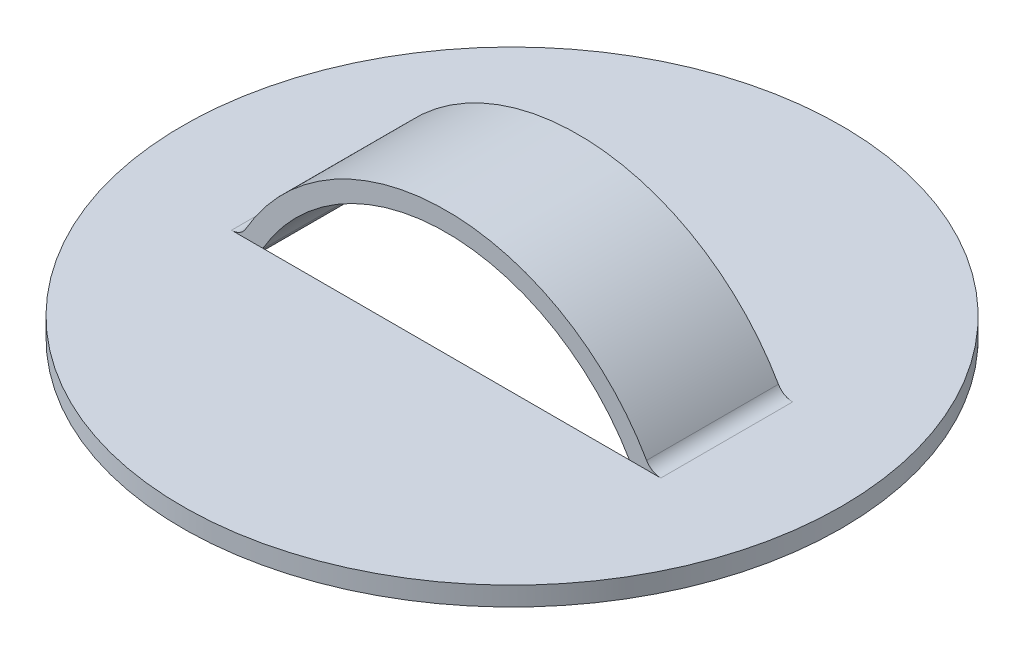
ISO-10303-21;
HEADER;
FILE_DESCRIPTION(('STEP AP214'),'2;1');
FILE_NAME('part.step','',(''),(''),'','','');
FILE_SCHEMA(('AUTOMOTIVE_DESIGN { 1 0 10303 214 1 1 1 1 }'));
ENDSEC;
DATA;
#1=APPLICATION_CONTEXT('core data for automotive mechanical design processes');
#2=APPLICATION_PROTOCOL_DEFINITION('international standard','automotive_design',2000,#1);
#3=PRODUCT_CONTEXT('',#1,'mechanical');
#4=PRODUCT('Part','Part','',(#3));
#5=PRODUCT_RELATED_PRODUCT_CATEGORY('part','',(#4));
#6=PRODUCT_DEFINITION_FORMATION('','',#4);
#7=PRODUCT_DEFINITION_CONTEXT('part definition',#1,'design');
#8=PRODUCT_DEFINITION('design','',#6,#7);
#9=PRODUCT_DEFINITION_SHAPE('','',#8);
#10=(LENGTH_UNIT() NAMED_UNIT(*) SI_UNIT(.MILLI.,.METRE.));
#11=(NAMED_UNIT(*) PLANE_ANGLE_UNIT() SI_UNIT($,.RADIAN.));
#12=(NAMED_UNIT(*) SI_UNIT($,.STERADIAN.) SOLID_ANGLE_UNIT());
#13=UNCERTAINTY_MEASURE_WITH_UNIT(LENGTH_MEASURE(1.E-05),#10,'distance_accuracy_value','');
#14=(GEOMETRIC_REPRESENTATION_CONTEXT(3) GLOBAL_UNCERTAINTY_ASSIGNED_CONTEXT((#13)) GLOBAL_UNIT_ASSIGNED_CONTEXT((#10,
#11,#12)) REPRESENTATION_CONTEXT('',''));
#15=CARTESIAN_POINT('',(0.,0.,0.));
#16=DIRECTION('',(0.,0.,1.));
#17=DIRECTION('',(1.,0.,0.));
#18=AXIS2_PLACEMENT_3D('',#15,#16,#17);
#19=CARTESIAN_POINT('',(-10.338517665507,0.7874,6.35));
#20=DIRECTION('',(0.,0.,1.));
#21=DIRECTION('',(1.,0.,0.));
#22=AXIS2_PLACEMENT_3D('',#19,#20,#21);
#23=PLANE('',#22);
#24=CARTESIAN_POINT('',(-10.338517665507,0.7874,6.35));
#25=DIRECTION('',(0.,0.,-1.));
#26=DIRECTION('',(1.,0.,0.));
#27=AXIS2_PLACEMENT_3D('',#24,#25,#26);
#28=CIRCLE('',#27,0.7874);
#29=CARTESIAN_POINT('',(-9.65516148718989,0.396218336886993,6.35));
#30=VERTEX_POINT('',#29);
#31=CARTESIAN_POINT('',(-10.338517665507,0.,6.35));
#32=VERTEX_POINT('',#31);
#33=EDGE_CURVE('E141',#30,#32,#28,.T.);
#34=ORIENTED_EDGE('',*,*,#33,.T.);
#35=DIRECTION('',(-1.,0.,0.));
#36=VECTOR('',#35,1.);
#37=CARTESIAN_POINT('',(-10.338517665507,0.,6.35));
#38=LINE('',#37,#36);
#39=CARTESIAN_POINT('',(-8.82809877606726,0.,6.35));
#40=VERTEX_POINT('',#39);
#41=EDGE_CURVE('E59',#40,#32,#38,.T.);
#42=ORIENTED_EDGE('',*,*,#41,.F.);
#43=CARTESIAN_POINT('',(0.,-5.1308,6.35));
#44=DIRECTION('',(0.,0.,-1.));
#45=DIRECTION('',(1.,0.,0.));
#46=AXIS2_PLACEMENT_3D('',#43,#44,#45);
#47=CIRCLE('',#46,10.2108);
#48=CARTESIAN_POINT('',(8.82809877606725,0.,6.35));
#49=VERTEX_POINT('',#48);
#50=EDGE_CURVE('E195',#40,#49,#47,.T.);
#51=ORIENTED_EDGE('',*,*,#50,.T.);
#52=CARTESIAN_POINT('',(10.338517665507,0.,6.35));
#53=VERTEX_POINT('',#52);
#54=EDGE_CURVE('E191',#53,#49,#38,.T.);
#55=ORIENTED_EDGE('',*,*,#54,.F.);
#56=CARTESIAN_POINT('',(10.338517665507,0.7874,6.35));
#57=DIRECTION('',(0.,0.,-1.));
#58=DIRECTION('',(-1.,0.,0.));
#59=AXIS2_PLACEMENT_3D('',#56,#57,#58);
#60=CIRCLE('',#59,0.7874);
#61=CARTESIAN_POINT('',(9.65516148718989,0.396218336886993,6.35));
#62=VERTEX_POINT('',#61);
#63=EDGE_CURVE('E197',#53,#62,#60,.T.);
#64=ORIENTED_EDGE('',*,*,#63,.T.);
#65=CARTESIAN_POINT('',(0.,-5.1308,6.35));
#66=DIRECTION('',(0.,0.,1.));
#67=DIRECTION('',(1.,0.,0.));
#68=AXIS2_PLACEMENT_3D('',#65,#66,#67);
#69=CIRCLE('',#68,11.1252);
#70=EDGE_CURVE('E145',#62,#30,#69,.T.);
#71=ORIENTED_EDGE('',*,*,#70,.T.);
#72=EDGE_LOOP('',(#34,#42,#51,#55,#64,#71));
#73=FACE_BOUND('',#72,.T.);
#74=ADVANCED_FACE('F37',(#73),#23,.T.);
#75=CARTESIAN_POINT('',(-10.338517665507,0.7874,0.));
#76=DIRECTION('',(0.,0.,1.));
#77=DIRECTION('',(1.,0.,0.));
#78=AXIS2_PLACEMENT_3D('',#75,#76,#77);
#79=PLANE('',#78);
#80=DIRECTION('',(1.,0.,0.));
#81=VECTOR('',#80,1.);
#82=CARTESIAN_POINT('',(-10.338517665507,0.,0.));
#83=LINE('',#82,#81);
#84=CARTESIAN_POINT('',(-10.338517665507,0.,0.));
#85=VERTEX_POINT('',#84);
#86=CARTESIAN_POINT('',(-8.82809877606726,0.,0.));
#87=VERTEX_POINT('',#86);
#88=EDGE_CURVE('E114',#85,#87,#83,.T.);
#89=ORIENTED_EDGE('',*,*,#88,.F.);
#90=CARTESIAN_POINT('',(-10.338517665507,0.7874,0.));
#91=DIRECTION('',(0.,0.,-1.));
#92=DIRECTION('',(1.,0.,0.));
#93=AXIS2_PLACEMENT_3D('',#90,#91,#92);
#94=CIRCLE('',#93,0.7874);
#95=CARTESIAN_POINT('',(-9.65516148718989,0.396218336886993,0.));
#96=VERTEX_POINT('',#95);
#97=EDGE_CURVE('E118',#96,#85,#94,.T.);
#98=ORIENTED_EDGE('',*,*,#97,.F.);
#99=CARTESIAN_POINT('',(0.,-5.1308,0.));
#100=DIRECTION('',(0.,0.,1.));
#101=DIRECTION('',(1.,0.,0.));
#102=AXIS2_PLACEMENT_3D('',#99,#100,#101);
#103=CIRCLE('',#102,11.1252);
#104=CARTESIAN_POINT('',(9.65516148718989,0.396218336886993,0.));
#105=VERTEX_POINT('',#104);
#106=EDGE_CURVE('E137',#105,#96,#103,.T.);
#107=ORIENTED_EDGE('',*,*,#106,.F.);
#108=CARTESIAN_POINT('',(10.338517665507,0.7874,0.));
#109=DIRECTION('',(0.,0.,-1.));
#110=DIRECTION('',(-1.,0.,0.));
#111=AXIS2_PLACEMENT_3D('',#108,#109,#110);
#112=CIRCLE('',#111,0.7874);
#113=CARTESIAN_POINT('',(10.338517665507,0.,0.));
#114=VERTEX_POINT('',#113);
#115=EDGE_CURVE('E207',#114,#105,#112,.T.);
#116=ORIENTED_EDGE('',*,*,#115,.F.);
#117=DIRECTION('',(1.,0.,0.));
#118=VECTOR('',#117,1.);
#119=CARTESIAN_POINT('',(-10.338517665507,0.,0.));
#120=LINE('',#119,#118);
#121=CARTESIAN_POINT('',(8.82809877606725,0.,0.));
#122=VERTEX_POINT('',#121);
#123=EDGE_CURVE('E11',#122,#114,#120,.T.);
#124=ORIENTED_EDGE('',*,*,#123,.F.);
#125=CARTESIAN_POINT('',(0.,-5.1308,0.));
#126=DIRECTION('',(0.,0.,-1.));
#127=DIRECTION('',(1.,0.,0.));
#128=AXIS2_PLACEMENT_3D('',#125,#126,#127);
#129=CIRCLE('',#128,10.2108);
#130=EDGE_CURVE('E121',#87,#122,#129,.T.);
#131=ORIENTED_EDGE('',*,*,#130,.F.);
#132=EDGE_LOOP('',(#89,#98,#107,#116,#124,#131));
#133=FACE_BOUND('',#132,.T.);
#134=ADVANCED_FACE('F116',(#133),#79,.F.);
#135=CARTESIAN_POINT('',(-10.338517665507,0.7874,6.35));
#136=DIRECTION('',(0.,0.,-1.));
#137=DIRECTION('',(-1.,0.,0.));
#138=AXIS2_PLACEMENT_3D('',#135,#136,#137);
#139=CYLINDRICAL_SURFACE('',#138,1.7018);
#140=CARTESIAN_POINT('',(-10.338517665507,0.7874,0.));
#141=DIRECTION('',(0.,0.,1.));
#142=DIRECTION('',(1.,0.,0.));
#143=AXIS2_PLACEMENT_3D('',#140,#141,#142);
#144=CIRCLE('',#143,1.7018);
#145=CARTESIAN_POINT('',(-10.338517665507,-0.914399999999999,0.));
#146=VERTEX_POINT('',#145);
#147=CARTESIAN_POINT('',(-8.86158657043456,-0.0580571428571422,0.));
#148=VERTEX_POINT('',#147);
#149=EDGE_CURVE('E167',#146,#148,#144,.T.);
#150=ORIENTED_EDGE('',*,*,#149,.T.);
#151=DIRECTION('',(0.,0.,-1.));
#152=VECTOR('',#151,1.);
#153=CARTESIAN_POINT('',(-8.86158657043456,-0.0580571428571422,6.35));
#154=LINE('',#153,#152);
#155=CARTESIAN_POINT('',(-8.86158657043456,-0.0580571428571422,6.35));
#156=VERTEX_POINT('',#155);
#157=EDGE_CURVE('E160',#156,#148,#154,.T.);
#158=ORIENTED_EDGE('',*,*,#157,.F.);
#159=CARTESIAN_POINT('',(-10.338517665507,0.7874,6.35));
#160=DIRECTION('',(0.,0.,1.));
#161=DIRECTION('',(1.,0.,0.));
#162=AXIS2_PLACEMENT_3D('',#159,#160,#161);
#163=CIRCLE('',#162,1.7018);
#164=CARTESIAN_POINT('',(-10.338517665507,-0.914400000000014,6.35));
#165=VERTEX_POINT('',#164);
#166=EDGE_CURVE('E136',#165,#156,#163,.T.);
#167=ORIENTED_EDGE('',*,*,#166,.F.);
#168=DIRECTION('',(0.,0.,-1.));
#169=VECTOR('',#168,1.);
#170=CARTESIAN_POINT('',(-10.338517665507,-0.914399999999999,6.35));
#171=LINE('',#170,#169);
#172=EDGE_CURVE('E45',#165,#146,#171,.T.);
#173=ORIENTED_EDGE('',*,*,#172,.T.);
#174=EDGE_LOOP('',(#150,#158,#167,#173));
#175=FACE_BOUND('',#174,.T.);
#176=ADVANCED_FACE('F39',(#175),#139,.T.);
#177=CARTESIAN_POINT('',(0.,-5.1308,6.35));
#178=DIRECTION('',(0.,0.,-1.));
#179=DIRECTION('',(-1.,0.,0.));
#180=AXIS2_PLACEMENT_3D('',#177,#178,#179);
#181=CYLINDRICAL_SURFACE('',#180,10.2108);
#182=EDGE_CURVE('E202',#148,#87,#129,.T.);
#183=ORIENTED_EDGE('',*,*,#182,.T.);
#184=ORIENTED_EDGE('',*,*,#130,.T.);
#185=CARTESIAN_POINT('',(8.86158657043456,-0.0580571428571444,0.));
#186=VERTEX_POINT('',#185);
#187=EDGE_CURVE('E201',#122,#186,#129,.T.);
#188=ORIENTED_EDGE('',*,*,#187,.T.);
#189=DIRECTION('',(0.,0.,-1.));
#190=VECTOR('',#189,1.);
#191=CARTESIAN_POINT('',(8.86158657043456,-0.0580571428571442,6.35));
#192=LINE('',#191,#190);
#193=CARTESIAN_POINT('',(8.86158657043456,-0.0580571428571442,6.35));
#194=VERTEX_POINT('',#193);
#195=EDGE_CURVE('E157',#194,#186,#192,.T.);
#196=ORIENTED_EDGE('',*,*,#195,.F.);
#197=EDGE_CURVE('E52',#49,#194,#47,.T.);
#198=ORIENTED_EDGE('',*,*,#197,.F.);
#199=ORIENTED_EDGE('',*,*,#50,.F.);
#200=EDGE_CURVE('E193',#156,#40,#47,.T.);
#201=ORIENTED_EDGE('',*,*,#200,.F.);
#202=ORIENTED_EDGE('',*,*,#157,.T.);
#203=EDGE_LOOP('',(#183,#184,#188,#196,#198,#199,#201,#202));
#204=FACE_BOUND('',#203,.T.);
#205=ADVANCED_FACE('F221',(#204),#181,.F.);
#206=CARTESIAN_POINT('',(10.338517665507,0.7874,6.35));
#207=DIRECTION('',(0.,0.,-1.));
#208=DIRECTION('',(-1.,0.,0.));
#209=AXIS2_PLACEMENT_3D('',#206,#207,#208);
#210=CYLINDRICAL_SURFACE('',#209,1.7018);
#211=CARTESIAN_POINT('',(10.338517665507,0.7874,0.));
#212=DIRECTION('',(0.,0.,1.));
#213=DIRECTION('',(-1.,0.,0.));
#214=AXIS2_PLACEMENT_3D('',#211,#212,#213);
#215=CIRCLE('',#214,1.7018);
#216=CARTESIAN_POINT('',(10.338517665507,-0.914400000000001,0.));
#217=VERTEX_POINT('',#216);
#218=EDGE_CURVE('E204',#186,#217,#215,.T.);
#219=ORIENTED_EDGE('',*,*,#218,.T.);
#220=DIRECTION('',(0.,0.,-1.));
#221=VECTOR('',#220,1.);
#222=CARTESIAN_POINT('',(10.338517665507,-0.914400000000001,6.35));
#223=LINE('',#222,#221);
#224=CARTESIAN_POINT('',(10.338517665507,-0.914400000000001,6.35));
#225=VERTEX_POINT('',#224);
#226=EDGE_CURVE('E154',#225,#217,#223,.T.);
#227=ORIENTED_EDGE('',*,*,#226,.F.);
#228=CARTESIAN_POINT('',(10.338517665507,0.7874,6.35));
#229=DIRECTION('',(0.,0.,1.));
#230=DIRECTION('',(-1.,0.,0.));
#231=AXIS2_PLACEMENT_3D('',#228,#229,#230);
#232=CIRCLE('',#231,1.7018);
#233=EDGE_CURVE('E180',#194,#225,#232,.T.);
#234=ORIENTED_EDGE('',*,*,#233,.F.);
#235=ORIENTED_EDGE('',*,*,#195,.T.);
#236=EDGE_LOOP('',(#219,#227,#234,#235));
#237=FACE_BOUND('',#236,.T.);
#238=ADVANCED_FACE('F246',(#237),#210,.T.);
#239=CARTESIAN_POINT('',(10.338517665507,-0.914400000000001,6.35));
#240=DIRECTION('',(0.,1.,0.));
#241=DIRECTION('',(-1.,0.,0.));
#242=AXIS2_PLACEMENT_3D('',#239,#240,#241);
#243=PLANE('',#242);
#244=CARTESIAN_POINT('',(0.,-0.914400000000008,3.175));
#245=DIRECTION('',(0.,-1.,0.));
#246=DIRECTION('',(1.,0.,0.));
#247=AXIS2_PLACEMENT_3D('',#244,#245,#246);
#248=CIRCLE('',#247,15.875);
#249=CARTESIAN_POINT('',(15.875,-0.914399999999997,3.175));
#250=VERTEX_POINT('',#249);
#251=EDGE_CURVE('E188',#250,#250,#248,.T.);
#252=ORIENTED_EDGE('',*,*,#251,.T.);
#253=EDGE_LOOP('',(#252));
#254=FACE_BOUND('',#253,.T.);
#255=ORIENTED_EDGE('',*,*,#172,.F.);
#256=DIRECTION('',(-1.,0.,0.));
#257=VECTOR('',#256,1.);
#258=CARTESIAN_POINT('',(-10.338517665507,-0.914400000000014,6.35));
#259=LINE('',#258,#257);
#260=EDGE_CURVE('E173',#225,#165,#259,.T.);
#261=ORIENTED_EDGE('',*,*,#260,.F.);
#262=ORIENTED_EDGE('',*,*,#226,.T.);
#263=DIRECTION('',(1.,0.,0.));
#264=VECTOR('',#263,1.);
#265=CARTESIAN_POINT('',(-10.338517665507,-0.914400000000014,0.));
#266=LINE('',#265,#264);
#267=EDGE_CURVE('E174',#146,#217,#266,.T.);
#268=ORIENTED_EDGE('',*,*,#267,.F.);
#269=EDGE_LOOP('',(#255,#261,#262,#268));
#270=FACE_BOUND('',#269,.T.);
#271=ADVANCED_FACE('F172',(#254,#270),#243,.F.);
#272=CARTESIAN_POINT('',(10.338517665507,0.7874,6.35));
#273=DIRECTION('',(0.,0.,-1.));
#274=DIRECTION('',(-1.,0.,0.));
#275=AXIS2_PLACEMENT_3D('',#272,#273,#274);
#276=CYLINDRICAL_SURFACE('',#275,0.7874);
#277=ORIENTED_EDGE('',*,*,#115,.T.);
#278=DIRECTION('',(0.,0.,-1.));
#279=VECTOR('',#278,1.);
#280=CARTESIAN_POINT('',(9.65516148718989,0.396218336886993,6.35));
#281=LINE('',#280,#279);
#282=EDGE_CURVE('E143',#62,#105,#281,.T.);
#283=ORIENTED_EDGE('',*,*,#282,.F.);
#284=ORIENTED_EDGE('',*,*,#63,.F.);
#285=DIRECTION('',(0.,0.,-1.));
#286=VECTOR('',#285,1.);
#287=CARTESIAN_POINT('',(10.338517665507,0.,6.35));
#288=LINE('',#287,#286);
#289=EDGE_CURVE('E151',#53,#114,#288,.T.);
#290=ORIENTED_EDGE('',*,*,#289,.T.);
#291=EDGE_LOOP('',(#277,#283,#284,#290));
#292=FACE_BOUND('',#291,.T.);
#293=ADVANCED_FACE('F214',(#292),#276,.F.);
#294=CARTESIAN_POINT('',(0.,-5.1308,6.35));
#295=DIRECTION('',(0.,0.,-1.));
#296=DIRECTION('',(-1.,0.,0.));
#297=AXIS2_PLACEMENT_3D('',#294,#295,#296);
#298=CYLINDRICAL_SURFACE('',#297,11.1252);
#299=ORIENTED_EDGE('',*,*,#106,.T.);
#300=DIRECTION('',(0.,0.,-1.));
#301=VECTOR('',#300,1.);
#302=CARTESIAN_POINT('',(-9.65516148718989,0.396218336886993,6.35));
#303=LINE('',#302,#301);
#304=EDGE_CURVE('E135',#30,#96,#303,.T.);
#305=ORIENTED_EDGE('',*,*,#304,.F.);
#306=ORIENTED_EDGE('',*,*,#70,.F.);
#307=ORIENTED_EDGE('',*,*,#282,.T.);
#308=EDGE_LOOP('',(#299,#305,#306,#307));
#309=FACE_BOUND('',#308,.T.);
#310=ADVANCED_FACE('F209',(#309),#298,.T.);
#311=CARTESIAN_POINT('',(-10.338517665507,0.7874,6.35));
#312=DIRECTION('',(0.,0.,-1.));
#313=DIRECTION('',(-1.,0.,0.));
#314=AXIS2_PLACEMENT_3D('',#311,#312,#313);
#315=CYLINDRICAL_SURFACE('',#314,0.7874);
#316=ORIENTED_EDGE('',*,*,#97,.T.);
#317=DIRECTION('',(0.,0.,-1.));
#318=VECTOR('',#317,1.);
#319=CARTESIAN_POINT('',(-10.338517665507,0.,6.35));
#320=LINE('',#319,#318);
#321=EDGE_CURVE('E133',#32,#85,#320,.T.);
#322=ORIENTED_EDGE('',*,*,#321,.F.);
#323=ORIENTED_EDGE('',*,*,#33,.F.);
#324=ORIENTED_EDGE('',*,*,#304,.T.);
#325=EDGE_LOOP('',(#316,#322,#323,#324));
#326=FACE_BOUND('',#325,.T.);
#327=ADVANCED_FACE('F131',(#326),#315,.F.);
#328=CARTESIAN_POINT('',(-15.875,0.,6.35));
#329=DIRECTION('',(0.,-1.,0.));
#330=DIRECTION('',(0.,0.,-1.));
#331=AXIS2_PLACEMENT_3D('',#328,#329,#330);
#332=PLANE('',#331);
#333=CARTESIAN_POINT('',(0.,0.,3.175));
#334=DIRECTION('',(0.,-1.,0.));
#335=DIRECTION('',(1.,0.,0.));
#336=AXIS2_PLACEMENT_3D('',#333,#334,#335);
#337=CIRCLE('',#336,15.875);
#338=CARTESIAN_POINT('',(15.875,0.,3.175));
#339=VERTEX_POINT('',#338);
#340=EDGE_CURVE('E185',#339,#339,#337,.T.);
#341=ORIENTED_EDGE('',*,*,#340,.F.);
#342=EDGE_LOOP('',(#341));
#343=FACE_BOUND('',#342,.T.);
#344=ORIENTED_EDGE('',*,*,#41,.T.);
#345=ORIENTED_EDGE('',*,*,#321,.T.);
#346=ORIENTED_EDGE('',*,*,#88,.T.);
#347=EDGE_CURVE('E126',#87,#122,#83,.T.);
#348=ORIENTED_EDGE('',*,*,#347,.T.);
#349=ORIENTED_EDGE('',*,*,#123,.T.);
#350=ORIENTED_EDGE('',*,*,#289,.F.);
#351=ORIENTED_EDGE('',*,*,#54,.T.);
#352=EDGE_CURVE('E224',#49,#40,#38,.T.);
#353=ORIENTED_EDGE('',*,*,#352,.T.);
#354=EDGE_LOOP('',(#344,#345,#346,#348,#349,#350,#351,#353));
#355=FACE_BOUND('',#354,.T.);
#356=ADVANCED_FACE('F139',(#343,#355),#332,.F.);
#357=CARTESIAN_POINT('',(-10.338517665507,0.,0.));
#358=DIRECTION('',(0.,0.,-1.));
#359=DIRECTION('',(-1.,0.,0.));
#360=AXIS2_PLACEMENT_3D('',#357,#358,#359);
#361=PLANE('',#360);
#362=ORIENTED_EDGE('',*,*,#182,.F.);
#363=ORIENTED_EDGE('',*,*,#149,.F.);
#364=ORIENTED_EDGE('',*,*,#267,.T.);
#365=ORIENTED_EDGE('',*,*,#218,.F.);
#366=ORIENTED_EDGE('',*,*,#187,.F.);
#367=ORIENTED_EDGE('',*,*,#347,.F.);
#368=EDGE_LOOP('',(#362,#363,#364,#365,#366,#367));
#369=FACE_BOUND('',#368,.T.);
#370=ADVANCED_FACE('F219',(#369),#361,.F.);
#371=CARTESIAN_POINT('',(-10.338517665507,0.,6.35));
#372=DIRECTION('',(0.,0.,1.));
#373=DIRECTION('',(1.,0.,0.));
#374=AXIS2_PLACEMENT_3D('',#371,#372,#373);
#375=PLANE('',#374);
#376=ORIENTED_EDGE('',*,*,#260,.T.);
#377=ORIENTED_EDGE('',*,*,#166,.T.);
#378=ORIENTED_EDGE('',*,*,#200,.T.);
#379=ORIENTED_EDGE('',*,*,#352,.F.);
#380=ORIENTED_EDGE('',*,*,#197,.T.);
#381=ORIENTED_EDGE('',*,*,#233,.T.);
#382=EDGE_LOOP('',(#376,#377,#378,#379,#380,#381));
#383=FACE_BOUND('',#382,.T.);
#384=ADVANCED_FACE('F177',(#383),#375,.F.);
#385=CARTESIAN_POINT('',(0.,0.,3.175));
#386=DIRECTION('',(0.,-1.,0.));
#387=DIRECTION('',(1.,0.,0.));
#388=AXIS2_PLACEMENT_3D('',#385,#386,#387);
#389=CYLINDRICAL_SURFACE('',#388,15.875);
#390=ORIENTED_EDGE('',*,*,#251,.F.);
#391=EDGE_LOOP('',(#390));
#392=FACE_BOUND('',#391,.T.);
#393=ORIENTED_EDGE('',*,*,#340,.T.);
#394=EDGE_LOOP('',(#393));
#395=FACE_BOUND('',#394,.T.);
#396=ADVANCED_FACE('F232',(#392,#395),#389,.T.);
#397=CLOSED_SHELL('',(#74,#134,#176,#205,#238,#271,#293,#310,#327,#356,#370,#384,#396));
#398=MANIFOLD_SOLID_BREP('B2',#397);
#399=ADVANCED_BREP_SHAPE_REPRESENTATION('',(#18,#398),#14);
#400=SHAPE_DEFINITION_REPRESENTATION(#9,#399);
ENDSEC;
END-ISO-10303-21;
